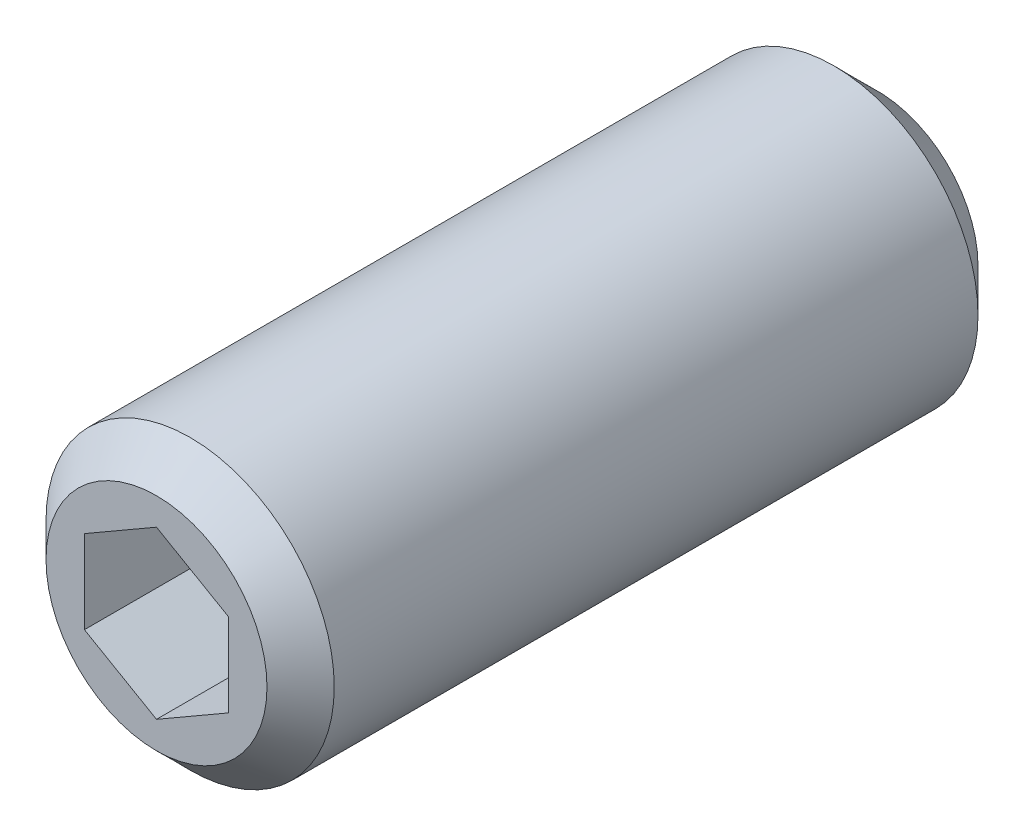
ISO-10303-21;
HEADER;
FILE_DESCRIPTION(('STEP AP214'),'2;1');
FILE_NAME('part.step','',(''),(''),'','','');
FILE_SCHEMA(('AUTOMOTIVE_DESIGN { 1 0 10303 214 1 1 1 1 }'));
ENDSEC;
DATA;
#1=APPLICATION_CONTEXT('core data for automotive mechanical design processes');
#2=APPLICATION_PROTOCOL_DEFINITION('international standard','automotive_design',2000,#1);
#3=PRODUCT_CONTEXT('',#1,'mechanical');
#4=PRODUCT('Part','Part','',(#3));
#5=PRODUCT_RELATED_PRODUCT_CATEGORY('part','',(#4));
#6=PRODUCT_DEFINITION_FORMATION('','',#4);
#7=PRODUCT_DEFINITION_CONTEXT('part definition',#1,'design');
#8=PRODUCT_DEFINITION('design','',#6,#7);
#9=PRODUCT_DEFINITION_SHAPE('','',#8);
#10=(LENGTH_UNIT() NAMED_UNIT(*) SI_UNIT(.MILLI.,.METRE.));
#11=(NAMED_UNIT(*) PLANE_ANGLE_UNIT() SI_UNIT($,.RADIAN.));
#12=(NAMED_UNIT(*) SI_UNIT($,.STERADIAN.) SOLID_ANGLE_UNIT());
#13=UNCERTAINTY_MEASURE_WITH_UNIT(LENGTH_MEASURE(1.E-05),#10,'distance_accuracy_value','');
#14=(GEOMETRIC_REPRESENTATION_CONTEXT(3) GLOBAL_UNCERTAINTY_ASSIGNED_CONTEXT((#13)) GLOBAL_UNIT_ASSIGNED_CONTEXT((#10,
#11,#12)) REPRESENTATION_CONTEXT('',''));
#15=CARTESIAN_POINT('',(0.,0.,0.));
#16=DIRECTION('',(0.,0.,1.));
#17=DIRECTION('',(1.,0.,0.));
#18=AXIS2_PLACEMENT_3D('',#15,#16,#17);
#19=CARTESIAN_POINT('',(-4.17804610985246E-10,0.,-7.48528137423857));
#20=DIRECTION('',(5.58168210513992E-11,0.,1.));
#21=DIRECTION('',(1.,0.,-5.58168210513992E-11));
#22=AXIS2_PLACEMENT_3D('',#19,#20,#21);
#23=CYLINDRICAL_SURFACE('',#22,3.);
#24=CARTESIAN_POINT('',(8.5399736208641E-10,0.,15.3));
#25=DIRECTION('',(-5.58168210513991E-11,0.,-1.));
#26=DIRECTION('',(-1.,0.,5.58168210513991E-11));
#27=AXIS2_PLACEMENT_3D('',#24,#25,#26);
#28=CIRCLE('',#27,3.);
#29=CARTESIAN_POINT('',(-2.999999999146,0.,15.3000000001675));
#30=VERTEX_POINT('',#29);
#31=EDGE_CURVE('E9',#30,#30,#28,.T.);
#32=ORIENTED_EDGE('',*,*,#31,.T.);
#33=EDGE_LOOP('',(#32));
#34=FACE_BOUND('',#33,.T.);
#35=CARTESIAN_POINT('',(1.06051959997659E-10,0.,1.9));
#36=DIRECTION('',(5.58168210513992E-11,0.,1.));
#37=DIRECTION('',(1.,0.,-5.58168210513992E-11));
#38=AXIS2_PLACEMENT_3D('',#35,#36,#37);
#39=CIRCLE('',#38,3.);
#40=CARTESIAN_POINT('',(3.00000000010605,0.,1.89999999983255));
#41=VERTEX_POINT('',#40);
#42=EDGE_CURVE('E122',#41,#41,#39,.T.);
#43=ORIENTED_EDGE('',*,*,#42,.T.);
#44=EDGE_LOOP('',(#43));
#45=FACE_BOUND('',#44,.T.);
#46=ADVANCED_FACE('F14',(#34,#45),#23,.T.);
#47=CARTESIAN_POINT('',(0.767999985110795,2.17545580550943,12.9999999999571));
#48=DIRECTION('',(-5.58168210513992E-11,0.,-1.));
#49=DIRECTION('',(0.500000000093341,-0.866025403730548,-2.79087373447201E-11));
#50=AXIS2_PLACEMENT_3D('',#47,#48,#49);
#51=PLANE('',#50);
#52=DIRECTION('',(0.86602540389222,-0.499999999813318,-4.83389736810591E-11));
#53=VECTOR('',#52,1.);
#54=CARTESIAN_POINT('',(-0.750000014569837,-1.29903811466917,13.0000000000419));
#55=LINE('',#54,#53);
#56=CARTESIAN_POINT('',(-1.50000001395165,-0.866025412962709,13.0000000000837));
#57=VERTEX_POINT('',#56);
#58=CARTESIAN_POINT('',(-1.40949231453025E-08,-1.73205081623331,13.));
#59=VERTEX_POINT('',#58);
#60=EDGE_CURVE('E79',#57,#59,#55,.T.);
#61=ORIENTED_EDGE('',*,*,#60,.T.);
#62=DIRECTION('',(0.866025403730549,0.500000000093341,-4.83385962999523E-11));
#63=VECTOR('',#62,1.);
#64=CARTESIAN_POINT('',(0.749999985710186,-1.29903811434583,12.9999999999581));
#65=LINE('',#64,#63);
#66=CARTESIAN_POINT('',(1.49999998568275,-0.866025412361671,12.9999999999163));
#67=VERTEX_POINT('',#66);
#68=EDGE_CURVE('E73',#59,#67,#65,.T.);
#69=ORIENTED_EDGE('',*,*,#68,.T.);
#70=DIRECTION('',(0.,1.,0.));
#71=VECTOR('',#70,1.);
#72=CARTESIAN_POINT('',(1.4999999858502,-8.42666214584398E-09,12.9999999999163));
#73=LINE('',#72,#71);
#74=CARTESIAN_POINT('',(1.499999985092,0.8660253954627,12.9999999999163));
#75=VERTEX_POINT('',#74);
#76=EDGE_CURVE('E76',#67,#75,#73,.T.);
#77=ORIENTED_EDGE('',*,*,#76,.T.);
#78=DIRECTION('',(-0.86602540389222,0.499999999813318,4.83389736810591E-11));
#79=VECTOR('',#78,1.);
#80=CARTESIAN_POINT('',(0.749999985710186,1.29903809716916,12.9999999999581));
#81=LINE('',#80,#79);
#82=CARTESIAN_POINT('',(-1.45972756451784E-08,1.73205079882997,13.));
#83=VERTEX_POINT('',#82);
#84=EDGE_CURVE('E91',#75,#83,#81,.T.);
#85=ORIENTED_EDGE('',*,*,#84,.T.);
#86=DIRECTION('',(-0.866025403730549,-0.500000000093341,4.83385962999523E-11));
#87=VECTOR('',#86,1.);
#88=CARTESIAN_POINT('',(-0.750000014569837,1.29903809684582,13.0000000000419));
#89=LINE('',#88,#87);
#90=CARTESIAN_POINT('',(-1.5000000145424,0.866025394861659,13.0000000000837));
#91=VERTEX_POINT('',#90);
#92=EDGE_CURVE('E96',#83,#91,#89,.T.);
#93=ORIENTED_EDGE('',*,*,#92,.T.);
#94=DIRECTION('',(0.,-1.,0.));
#95=VECTOR('',#94,1.);
#96=CARTESIAN_POINT('',(-1.50000001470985,-9.07334645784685E-09,13.0000000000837));
#97=LINE('',#96,#95);
#98=EDGE_CURVE('E99',#91,#57,#97,.T.);
#99=ORIENTED_EDGE('',*,*,#98,.T.);
#100=EDGE_LOOP('',(#61,#69,#77,#85,#93,#99));
#101=FACE_BOUND('',#100,.T.);
#102=ADVANCED_FACE('F74',(#101),#51,.F.);
#103=CARTESIAN_POINT('',(-1.42623740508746E-08,-1.73205081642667,16.));
#104=DIRECTION('',(-0.499999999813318,-0.866025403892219,2.79080837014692E-11));
#105=DIRECTION('',(-0.86602540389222,0.499999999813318,4.83389736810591E-11));
#106=AXIS2_PLACEMENT_3D('',#103,#104,#105);
#107=PLANE('',#106);
#108=DIRECTION('',(5.58168210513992E-11,0.,1.));
#109=VECTOR('',#108,1.);
#110=CARTESIAN_POINT('',(-1.43460997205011E-08,-1.73205081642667,14.5));
#111=LINE('',#110,#109);
#112=CARTESIAN_POINT('',(-1.3622374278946E-08,-1.73205081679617,16.));
#113=VERTEX_POINT('',#112);
#114=EDGE_CURVE('E53',#59,#113,#111,.T.);
#115=ORIENTED_EDGE('',*,*,#114,.F.);
#116=ORIENTED_EDGE('',*,*,#60,.F.);
#117=DIRECTION('',(-5.58168210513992E-11,0.,-1.));
#118=VECTOR('',#117,1.);
#119=CARTESIAN_POINT('',(-1.50000001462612,-0.866025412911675,14.5000000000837));
#120=LINE('',#119,#118);
#121=CARTESIAN_POINT('',(-1.50000001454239,-0.866025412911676,16.0000000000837));
#122=VERTEX_POINT('',#121);
#123=EDGE_CURVE('E101',#122,#57,#120,.T.);
#124=ORIENTED_EDGE('',*,*,#123,.F.);
#125=DIRECTION('',(-0.86602540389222,0.499999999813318,4.83389736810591E-11));
#126=VECTOR('',#125,1.);
#127=CARTESIAN_POINT('',(-1.42623740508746E-08,-1.73205081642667,16.));
#128=LINE('',#127,#126);
#129=EDGE_CURVE('E114',#122,#113,#128,.F.);
#130=ORIENTED_EDGE('',*,*,#129,.T.);
#131=EDGE_LOOP('',(#115,#116,#124,#130));
#132=FACE_BOUND('',#131,.T.);
#133=ADVANCED_FACE('F151',(#132),#107,.F.);
#134=CARTESIAN_POINT('',(1.49999998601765,-0.866025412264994,15.9999999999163));
#135=DIRECTION('',(0.500000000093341,-0.866025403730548,-2.79087373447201E-11));
#136=DIRECTION('',(-0.866025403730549,-0.500000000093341,4.83385962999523E-11));
#137=AXIS2_PLACEMENT_3D('',#134,#135,#136);
#138=PLANE('',#137);
#139=DIRECTION('',(-5.58168210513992E-11,0.,-1.));
#140=VECTOR('',#139,1.);
#141=CARTESIAN_POINT('',(1.49999998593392,-0.866025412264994,14.4999999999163));
#142=LINE('',#141,#140);
#143=CARTESIAN_POINT('',(1.49999998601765,-0.866025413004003,15.9999999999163));
#144=VERTEX_POINT('',#143);
#145=EDGE_CURVE('E80',#144,#67,#142,.T.);
#146=ORIENTED_EDGE('',*,*,#145,.T.);
#147=ORIENTED_EDGE('',*,*,#68,.F.);
#148=ORIENTED_EDGE('',*,*,#114,.T.);
#149=DIRECTION('',(0.866025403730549,0.500000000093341,-4.83385962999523E-11));
#150=VECTOR('',#149,1.);
#151=CARTESIAN_POINT('',(0.749999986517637,-1.29903811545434,15.9999999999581));
#152=LINE('',#151,#150);
#153=EDGE_CURVE('E47',#113,#144,#152,.T.);
#154=ORIENTED_EDGE('',*,*,#153,.T.);
#155=EDGE_LOOP('',(#146,#147,#148,#154));
#156=FACE_BOUND('',#155,.T.);
#157=ADVANCED_FACE('F82',(#156),#138,.F.);
#158=CARTESIAN_POINT('',(1.49999998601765,0.866025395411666,15.9999999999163));
#159=DIRECTION('',(1.,0.,-5.58168210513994E-11));
#160=DIRECTION('',(0.,-1.,0.));
#161=AXIS2_PLACEMENT_3D('',#158,#159,#160);
#162=PLANE('',#161);
#163=DIRECTION('',(-5.58168210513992E-11,0.,-1.));
#164=VECTOR('',#163,1.);
#165=CARTESIAN_POINT('',(1.49999998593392,0.866025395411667,14.4999999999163));
#166=LINE('',#165,#164);
#167=CARTESIAN_POINT('',(1.49999998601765,0.866025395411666,15.9999999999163));
#168=VERTEX_POINT('',#167);
#169=EDGE_CURVE('E88',#168,#75,#166,.T.);
#170=ORIENTED_EDGE('',*,*,#169,.T.);
#171=ORIENTED_EDGE('',*,*,#76,.F.);
#172=ORIENTED_EDGE('',*,*,#145,.F.);
#173=DIRECTION('',(0.,-1.,0.));
#174=VECTOR('',#173,1.);
#175=CARTESIAN_POINT('',(1.49999998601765,0.866025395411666,15.9999999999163));
#176=LINE('',#175,#174);
#177=EDGE_CURVE('E111',#144,#168,#176,.F.);
#178=ORIENTED_EDGE('',*,*,#177,.T.);
#179=EDGE_LOOP('',(#170,#171,#172,#178));
#180=FACE_BOUND('',#179,.T.);
#181=ADVANCED_FACE('F86',(#180),#162,.F.);
#182=CARTESIAN_POINT('',(-1.42623747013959E-08,1.73205079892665,16.));
#183=DIRECTION('',(0.499999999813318,0.866025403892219,-2.79080837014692E-11));
#184=DIRECTION('',(0.86602540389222,-0.499999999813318,-4.83389736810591E-11));
#185=AXIS2_PLACEMENT_3D('',#182,#183,#184);
#186=PLANE('',#185);
#187=DIRECTION('',(-5.58168210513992E-11,0.,-1.));
#188=VECTOR('',#187,1.);
#189=CARTESIAN_POINT('',(-1.43461004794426E-08,1.73205079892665,14.5));
#190=LINE('',#189,#188);
#191=CARTESIAN_POINT('',(-1.49023745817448E-08,1.73205079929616,16.));
#192=VERTEX_POINT('',#191);
#193=EDGE_CURVE('E95',#192,#83,#190,.T.);
#194=ORIENTED_EDGE('',*,*,#193,.T.);
#195=ORIENTED_EDGE('',*,*,#84,.F.);
#196=ORIENTED_EDGE('',*,*,#169,.F.);
#197=DIRECTION('',(0.86602540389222,-0.499999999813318,-4.83389736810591E-11));
#198=VECTOR('',#197,1.);
#199=CARTESIAN_POINT('',(-1.42623747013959E-08,1.73205079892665,16.));
#200=LINE('',#199,#198);
#201=EDGE_CURVE('E105',#168,#192,#200,.F.);
#202=ORIENTED_EDGE('',*,*,#201,.T.);
#203=EDGE_LOOP('',(#194,#195,#196,#202));
#204=FACE_BOUND('',#203,.T.);
#205=ADVANCED_FACE('F162',(#204),#186,.F.);
#206=CARTESIAN_POINT('',(-1.50000001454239,0.86602539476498,16.0000000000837));
#207=DIRECTION('',(-0.500000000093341,0.866025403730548,2.79087373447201E-11));
#208=DIRECTION('',(0.866025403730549,0.500000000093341,-4.83385962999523E-11));
#209=AXIS2_PLACEMENT_3D('',#206,#207,#208);
#210=PLANE('',#209);
#211=DIRECTION('',(-5.58168210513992E-11,0.,-1.));
#212=VECTOR('',#211,1.);
#213=CARTESIAN_POINT('',(-1.50000001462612,0.866025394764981,14.5000000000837));
#214=LINE('',#213,#212);
#215=CARTESIAN_POINT('',(-1.5000000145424,0.866025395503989,16.0000000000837));
#216=VERTEX_POINT('',#215);
#217=EDGE_CURVE('E98',#216,#91,#214,.T.);
#218=ORIENTED_EDGE('',*,*,#217,.T.);
#219=ORIENTED_EDGE('',*,*,#92,.F.);
#220=ORIENTED_EDGE('',*,*,#193,.F.);
#221=DIRECTION('',(-0.866025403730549,-0.500000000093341,4.83385962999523E-11));
#222=VECTOR('',#221,1.);
#223=CARTESIAN_POINT('',(-0.750000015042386,1.29903809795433,16.0000000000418));
#224=LINE('',#223,#222);
#225=EDGE_CURVE('E103',#192,#216,#224,.T.);
#226=ORIENTED_EDGE('',*,*,#225,.T.);
#227=EDGE_LOOP('',(#218,#219,#220,#226));
#228=FACE_BOUND('',#227,.T.);
#229=ADVANCED_FACE('F165',(#228),#210,.F.);
#230=CARTESIAN_POINT('',(-1.50000001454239,-0.866025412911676,16.0000000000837));
#231=DIRECTION('',(-1.,0.,5.58168210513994E-11));
#232=DIRECTION('',(0.,1.,0.));
#233=AXIS2_PLACEMENT_3D('',#230,#231,#232);
#234=PLANE('',#233);
#235=ORIENTED_EDGE('',*,*,#123,.T.);
#236=ORIENTED_EDGE('',*,*,#98,.F.);
#237=ORIENTED_EDGE('',*,*,#217,.F.);
#238=DIRECTION('',(0.,1.,0.));
#239=VECTOR('',#238,1.);
#240=CARTESIAN_POINT('',(-1.50000001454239,-0.866025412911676,16.0000000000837));
#241=LINE('',#240,#239);
#242=EDGE_CURVE('E32',#216,#122,#241,.F.);
#243=ORIENTED_EDGE('',*,*,#242,.T.);
#244=EDGE_LOOP('',(#235,#236,#237,#243));
#245=FACE_BOUND('',#244,.T.);
#246=ADVANCED_FACE('F169',(#245),#234,.F.);
#247=CARTESIAN_POINT('',(0.746866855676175,2.76831766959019,15.9999999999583));
#248=DIRECTION('',(-5.58168210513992E-11,0.,-1.));
#249=DIRECTION('',(0.500000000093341,-0.866025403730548,-2.79087373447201E-11));
#250=AXIS2_PLACEMENT_3D('',#247,#248,#249);
#251=PLANE('',#250);
#252=CARTESIAN_POINT('',(8.93069136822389E-10,0.,16.));
#253=DIRECTION('',(-5.58168210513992E-11,0.,-1.));
#254=DIRECTION('',(-1.,0.,5.58168210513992E-11));
#255=AXIS2_PLACEMENT_3D('',#252,#253,#254);
#256=CIRCLE('',#255,2.3);
#257=CARTESIAN_POINT('',(-2.29999999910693,0.,16.0000000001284));
#258=VERTEX_POINT('',#257);
#259=EDGE_CURVE('E24',#258,#258,#256,.F.);
#260=ORIENTED_EDGE('',*,*,#259,.T.);
#261=EDGE_LOOP('',(#260));
#262=FACE_BOUND('',#261,.T.);
#263=ORIENTED_EDGE('',*,*,#242,.F.);
#264=ORIENTED_EDGE('',*,*,#225,.F.);
#265=ORIENTED_EDGE('',*,*,#201,.F.);
#266=ORIENTED_EDGE('',*,*,#177,.F.);
#267=ORIENTED_EDGE('',*,*,#153,.F.);
#268=ORIENTED_EDGE('',*,*,#129,.F.);
#269=EDGE_LOOP('',(#263,#264,#265,#266,#267,#268));
#270=FACE_BOUND('',#269,.T.);
#271=ADVANCED_FACE('F128',(#262,#270),#251,.F.);
#272=CARTESIAN_POINT('',(2.90941019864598,-0.774220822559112,0.999999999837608));
#273=DIRECTION('',(5.58168210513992E-11,0.,1.));
#274=DIRECTION('',(-0.500000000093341,0.866025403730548,2.79087373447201E-11));
#275=AXIS2_PLACEMENT_3D('',#272,#273,#274);
#276=PLANE('',#275);
#277=CARTESIAN_POINT('',(-4.18620601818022E-11,0.,1.));
#278=DIRECTION('',(5.58168210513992E-11,0.,1.));
#279=DIRECTION('',(1.,0.,-5.58168210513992E-11));
#280=AXIS2_PLACEMENT_3D('',#277,#278,#279);
#281=CIRCLE('',#280,1.58113883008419);
#282=CARTESIAN_POINT('',(1.58113883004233,0.,0.999999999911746));
#283=VERTEX_POINT('',#282);
#284=EDGE_CURVE('E18',#283,#283,#281,.T.);
#285=ORIENTED_EDGE('',*,*,#284,.T.);
#286=EDGE_LOOP('',(#285));
#287=FACE_BOUND('',#286,.T.);
#288=CARTESIAN_POINT('',(5.58168210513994E-11,0.,1.));
#289=DIRECTION('',(5.58168210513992E-11,0.,1.));
#290=DIRECTION('',(1.,0.,-5.58168210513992E-11));
#291=AXIS2_PLACEMENT_3D('',#288,#289,#290);
#292=CIRCLE('',#291,2.1);
#293=CARTESIAN_POINT('',(2.10000000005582,0.,0.999999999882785));
#294=VERTEX_POINT('',#293);
#295=EDGE_CURVE('E116',#294,#294,#292,.F.);
#296=ORIENTED_EDGE('',*,*,#295,.T.);
#297=EDGE_LOOP('',(#296));
#298=FACE_BOUND('',#297,.T.);
#299=ADVANCED_FACE('F142',(#287,#298),#276,.F.);
#300=CARTESIAN_POINT('',(5.58168210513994E-11,0.,1.));
#301=DIRECTION('',(5.58168210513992E-11,0.,1.));
#302=DIRECTION('',(1.,0.,-5.58168210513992E-11));
#303=AXIS2_PLACEMENT_3D('',#300,#301,#302);
#304=CONICAL_SURFACE('',#303,2.1,0.785398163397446);
#305=ORIENTED_EDGE('',*,*,#42,.F.);
#306=EDGE_LOOP('',(#305));
#307=FACE_BOUND('',#306,.T.);
#308=ORIENTED_EDGE('',*,*,#295,.F.);
#309=EDGE_LOOP('',(#308));
#310=FACE_BOUND('',#309,.T.);
#311=ADVANCED_FACE('F133',(#307,#310),#304,.T.);
#312=CARTESIAN_POINT('',(8.93069136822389E-10,0.,16.));
#313=DIRECTION('',(-5.58168210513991E-11,0.,-1.));
#314=DIRECTION('',(-1.,0.,5.58168210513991E-11));
#315=AXIS2_PLACEMENT_3D('',#312,#313,#314);
#316=CONICAL_SURFACE('',#315,2.3,0.785398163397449);
#317=ORIENTED_EDGE('',*,*,#31,.F.);
#318=EDGE_LOOP('',(#317));
#319=FACE_BOUND('',#318,.T.);
#320=ORIENTED_EDGE('',*,*,#259,.F.);
#321=EDGE_LOOP('',(#320));
#322=FACE_BOUND('',#321,.T.);
#323=ADVANCED_FACE('F16',(#319,#322),#316,.T.);
#324=CARTESIAN_POINT('',(0.,0.,1.75));
#325=DIRECTION('',(0.,0.,-1.));
#326=DIRECTION('',(-1.,0.,0.));
#327=AXIS2_PLACEMENT_3D('',#324,#325,#326);
#328=SPHERICAL_SURFACE('',#327,1.75);
#329=ORIENTED_EDGE('',*,*,#284,.F.);
#330=EDGE_LOOP('',(#329));
#331=FACE_BOUND('',#330,.T.);
#332=ADVANCED_FACE('F132',(#331),#328,.T.);
#333=CLOSED_SHELL('',(#46,#102,#133,#157,#181,#205,#229,#246,#271,#299,#311,#323,#332));
#334=MANIFOLD_SOLID_BREP('B1',#333);
#335=ADVANCED_BREP_SHAPE_REPRESENTATION('',(#18,#334),#14);
#336=SHAPE_DEFINITION_REPRESENTATION(#9,#335);
ENDSEC;
END-ISO-10303-21;
